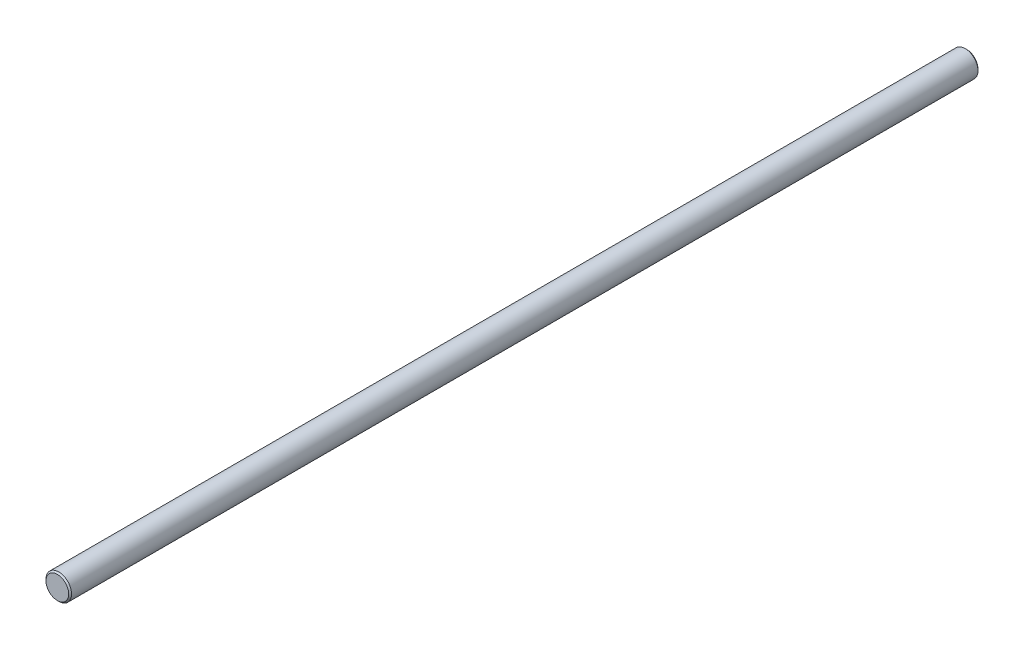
from build123d import *

# Parameters (mm, degrees)
SKETCH_1_R      = 4.5
EXTRUDE_1_DEPTH = 160
CHAMFER_1_SIZE  = 0.5


with BuildPart() as part:
    # Sketch 1 → Extrude 1 (new, symmetric)
    with BuildSketch(Plane.XY):
        Circle(SKETCH_1_R)
    extrude(amount=EXTRUDE_1_DEPTH, both=True)

    # Chamfer 1
    chamfer_1_edges = [part.edges().sort_by_distance(p)[0] for p in [
        (-4.5, 0, -160),
        (-4.5, 0, 160),
    ]]
    chamfer(chamfer_1_edges, length=CHAMFER_1_SIZE)


solid = part.part
